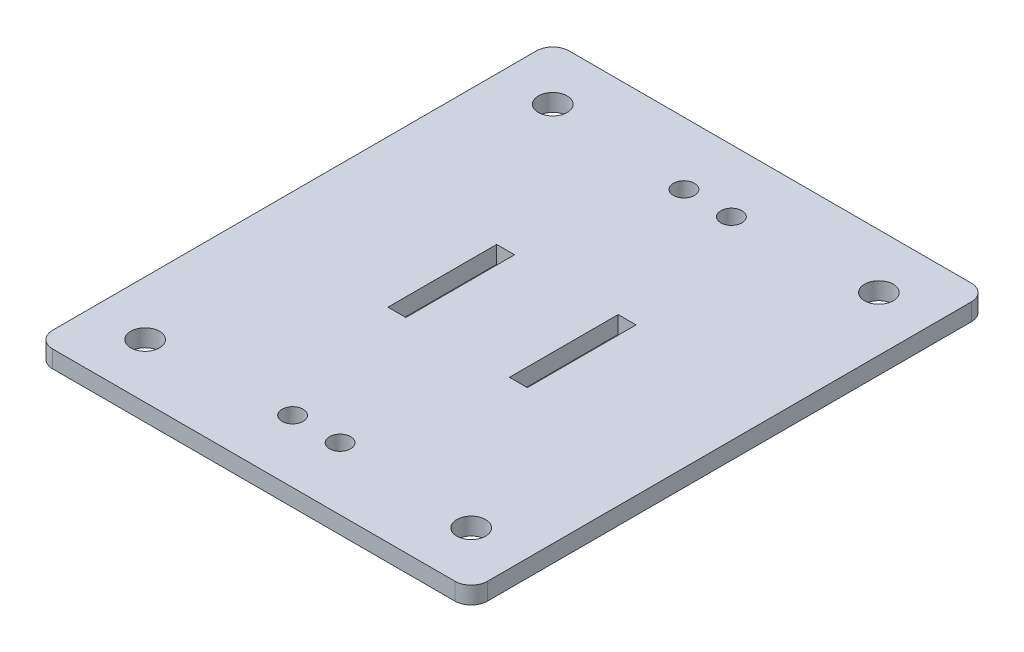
ISO-10303-21;
HEADER;
FILE_DESCRIPTION(('STEP AP214'),'2;1');
FILE_NAME('part.step','',(''),(''),'','','');
FILE_SCHEMA(('AUTOMOTIVE_DESIGN { 1 0 10303 214 1 1 1 1 }'));
ENDSEC;
DATA;
#1=APPLICATION_CONTEXT('core data for automotive mechanical design processes');
#2=APPLICATION_PROTOCOL_DEFINITION('international standard','automotive_design',2000,#1);
#3=PRODUCT_CONTEXT('',#1,'mechanical');
#4=PRODUCT('Part','Part','',(#3));
#5=PRODUCT_RELATED_PRODUCT_CATEGORY('part','',(#4));
#6=PRODUCT_DEFINITION_FORMATION('','',#4);
#7=PRODUCT_DEFINITION_CONTEXT('part definition',#1,'design');
#8=PRODUCT_DEFINITION('design','',#6,#7);
#9=PRODUCT_DEFINITION_SHAPE('','',#8);
#10=(LENGTH_UNIT() NAMED_UNIT(*) SI_UNIT(.MILLI.,.METRE.));
#11=(NAMED_UNIT(*) PLANE_ANGLE_UNIT() SI_UNIT($,.RADIAN.));
#12=(NAMED_UNIT(*) SI_UNIT($,.STERADIAN.) SOLID_ANGLE_UNIT());
#13=UNCERTAINTY_MEASURE_WITH_UNIT(LENGTH_MEASURE(1.E-05),#10,'distance_accuracy_value','');
#14=(GEOMETRIC_REPRESENTATION_CONTEXT(3) GLOBAL_UNCERTAINTY_ASSIGNED_CONTEXT((#13)) GLOBAL_UNIT_ASSIGNED_CONTEXT((#10,
#11,#12)) REPRESENTATION_CONTEXT('',''));
#15=CARTESIAN_POINT('',(0.,0.,0.));
#16=DIRECTION('',(0.,0.,1.));
#17=DIRECTION('',(1.,0.,0.));
#18=AXIS2_PLACEMENT_3D('',#15,#16,#17);
#19=CARTESIAN_POINT('',(0.,3.175,0.));
#20=DIRECTION('',(0.,-1.,0.));
#21=DIRECTION('',(0.,0.,-1.));
#22=AXIS2_PLACEMENT_3D('',#19,#20,#21);
#23=PLANE('',#22);
#24=DIRECTION('',(0.,0.,-1.));
#25=VECTOR('',#24,1.);
#26=CARTESIAN_POINT('',(52.825,3.175,-37.5));
#27=LINE('',#26,#25);
#28=CARTESIAN_POINT('',(52.825,3.175,-37.5));
#29=VERTEX_POINT('',#28);
#30=CARTESIAN_POINT('',(52.825,3.175,-57.5));
#31=VERTEX_POINT('',#30);
#32=EDGE_CURVE('E195',#29,#31,#27,.T.);
#33=ORIENTED_EDGE('',*,*,#32,.F.);
#34=DIRECTION('',(1.,0.,0.));
#35=VECTOR('',#34,1.);
#36=CARTESIAN_POINT('',(49.525,3.175,-37.5));
#37=LINE('',#36,#35);
#38=CARTESIAN_POINT('',(49.525,3.175,-37.5));
#39=VERTEX_POINT('',#38);
#40=EDGE_CURVE('E203',#39,#29,#37,.T.);
#41=ORIENTED_EDGE('',*,*,#40,.F.);
#42=DIRECTION('',(0.,0.,1.));
#43=VECTOR('',#42,1.);
#44=CARTESIAN_POINT('',(49.525,3.175,-37.5));
#45=LINE('',#44,#43);
#46=CARTESIAN_POINT('',(49.525,3.175,-57.5));
#47=VERTEX_POINT('',#46);
#48=EDGE_CURVE('E200',#47,#39,#45,.T.);
#49=ORIENTED_EDGE('',*,*,#48,.F.);
#50=DIRECTION('',(-1.,0.,0.));
#51=VECTOR('',#50,1.);
#52=CARTESIAN_POINT('',(49.525,3.175,-57.5));
#53=LINE('',#52,#51);
#54=EDGE_CURVE('E197',#31,#47,#53,.T.);
#55=ORIENTED_EDGE('',*,*,#54,.F.);
#56=EDGE_LOOP('',(#33,#41,#49,#55));
#57=FACE_BOUND('',#56,.T.);
#58=DIRECTION('',(-1.,0.,0.));
#59=VECTOR('',#58,1.);
#60=CARTESIAN_POINT('',(0.,3.175,-95.));
#61=LINE('',#60,#59);
#62=CARTESIAN_POINT('',(77.,3.175,-95.));
#63=VERTEX_POINT('',#62);
#64=CARTESIAN_POINT('',(3.,3.175,-95.));
#65=VERTEX_POINT('',#64);
#66=EDGE_CURVE('E234',#63,#65,#61,.T.);
#67=ORIENTED_EDGE('',*,*,#66,.T.);
#68=CARTESIAN_POINT('',(3.,3.175,-92.));
#69=DIRECTION('',(0.,-1.,0.));
#70=DIRECTION('',(0.,0.,-1.));
#71=AXIS2_PLACEMENT_3D('',#68,#69,#70);
#72=CIRCLE('',#71,3.);
#73=CARTESIAN_POINT('',(0.,3.175,-92.));
#74=VERTEX_POINT('',#73);
#75=EDGE_CURVE('E269',#65,#74,#72,.F.);
#76=ORIENTED_EDGE('',*,*,#75,.T.);
#77=DIRECTION('',(0.,0.,1.));
#78=VECTOR('',#77,1.);
#79=CARTESIAN_POINT('',(0.,3.175,0.));
#80=LINE('',#79,#78);
#81=CARTESIAN_POINT('',(0.,3.175,-3.));
#82=VERTEX_POINT('',#81);
#83=EDGE_CURVE('E226',#74,#82,#80,.T.);
#84=ORIENTED_EDGE('',*,*,#83,.T.);
#85=CARTESIAN_POINT('',(3.,3.175,-3.));
#86=DIRECTION('',(0.,-1.,0.));
#87=DIRECTION('',(0.,0.,-1.));
#88=AXIS2_PLACEMENT_3D('',#85,#86,#87);
#89=CIRCLE('',#88,3.);
#90=CARTESIAN_POINT('',(3.,3.175,0.));
#91=VERTEX_POINT('',#90);
#92=EDGE_CURVE('E265',#82,#91,#89,.F.);
#93=ORIENTED_EDGE('',*,*,#92,.T.);
#94=DIRECTION('',(1.,0.,0.));
#95=VECTOR('',#94,1.);
#96=CARTESIAN_POINT('',(0.,3.175,0.));
#97=LINE('',#96,#95);
#98=CARTESIAN_POINT('',(77.,3.175,0.));
#99=VERTEX_POINT('',#98);
#100=EDGE_CURVE('E229',#91,#99,#97,.T.);
#101=ORIENTED_EDGE('',*,*,#100,.T.);
#102=CARTESIAN_POINT('',(77.,3.175,-3.));
#103=DIRECTION('',(0.,-1.,0.));
#104=DIRECTION('',(0.,0.,-1.));
#105=AXIS2_PLACEMENT_3D('',#102,#103,#104);
#106=CIRCLE('',#105,3.);
#107=CARTESIAN_POINT('',(80.,3.175,-3.));
#108=VERTEX_POINT('',#107);
#109=EDGE_CURVE('E57',#99,#108,#106,.F.);
#110=ORIENTED_EDGE('',*,*,#109,.T.);
#111=DIRECTION('',(0.,0.,-1.));
#112=VECTOR('',#111,1.);
#113=CARTESIAN_POINT('',(80.,3.175,0.));
#114=LINE('',#113,#112);
#115=CARTESIAN_POINT('',(80.,3.175,-92.));
#116=VERTEX_POINT('',#115);
#117=EDGE_CURVE('E232',#108,#116,#114,.T.);
#118=ORIENTED_EDGE('',*,*,#117,.T.);
#119=CARTESIAN_POINT('',(77.,3.175,-92.));
#120=DIRECTION('',(0.,-1.,0.));
#121=DIRECTION('',(0.,0.,-1.));
#122=AXIS2_PLACEMENT_3D('',#119,#120,#121);
#123=CIRCLE('',#122,3.);
#124=EDGE_CURVE('E267',#116,#63,#123,.F.);
#125=ORIENTED_EDGE('',*,*,#124,.T.);
#126=EDGE_LOOP('',(#67,#76,#84,#93,#101,#110,#118,#125));
#127=FACE_BOUND('',#126,.T.);
#128=DIRECTION('',(1.,0.,0.));
#129=VECTOR('',#128,1.);
#130=CARTESIAN_POINT('',(30.475,3.175,-37.5));
#131=LINE('',#130,#129);
#132=CARTESIAN_POINT('',(27.175,3.175,-37.5));
#133=VERTEX_POINT('',#132);
#134=CARTESIAN_POINT('',(30.475,3.175,-37.5));
#135=VERTEX_POINT('',#134);
#136=EDGE_CURVE('E151',#133,#135,#131,.T.);
#137=ORIENTED_EDGE('',*,*,#136,.F.);
#138=DIRECTION('',(0.,0.,1.));
#139=VECTOR('',#138,1.);
#140=CARTESIAN_POINT('',(27.175,3.175,-37.5));
#141=LINE('',#140,#139);
#142=CARTESIAN_POINT('',(27.175,3.175,-57.5));
#143=VERTEX_POINT('',#142);
#144=EDGE_CURVE('E177',#143,#133,#141,.T.);
#145=ORIENTED_EDGE('',*,*,#144,.F.);
#146=DIRECTION('',(-1.,0.,0.));
#147=VECTOR('',#146,1.);
#148=CARTESIAN_POINT('',(30.475,3.175,-57.5));
#149=LINE('',#148,#147);
#150=CARTESIAN_POINT('',(30.475,3.175,-57.5));
#151=VERTEX_POINT('',#150);
#152=EDGE_CURVE('E175',#151,#143,#149,.T.);
#153=ORIENTED_EDGE('',*,*,#152,.F.);
#154=DIRECTION('',(0.,0.,-1.));
#155=VECTOR('',#154,1.);
#156=CARTESIAN_POINT('',(30.475,3.175,-37.5));
#157=LINE('',#156,#155);
#158=EDGE_CURVE('E161',#135,#151,#157,.T.);
#159=ORIENTED_EDGE('',*,*,#158,.F.);
#160=EDGE_LOOP('',(#137,#145,#153,#159));
#161=FACE_BOUND('',#160,.T.);
#162=CARTESIAN_POINT('',(44.3688,3.175,-83.5));
#163=DIRECTION('',(0.,1.,0.));
#164=DIRECTION('',(0.,0.,1.));
#165=AXIS2_PLACEMENT_3D('',#162,#163,#164);
#166=CIRCLE('',#165,1.94310000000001);
#167=CARTESIAN_POINT('',(44.3688,3.175,-81.5569));
#168=VERTEX_POINT('',#167);
#169=EDGE_CURVE('E184',#168,#168,#166,.T.);
#170=ORIENTED_EDGE('',*,*,#169,.F.);
#171=EDGE_LOOP('',(#170));
#172=FACE_BOUND('',#171,.T.);
#173=CARTESIAN_POINT('',(35.6312,3.175,-83.5));
#174=DIRECTION('',(0.,1.,0.));
#175=DIRECTION('',(0.,0.,-1.));
#176=AXIS2_PLACEMENT_3D('',#173,#174,#175);
#177=CIRCLE('',#176,1.94310000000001);
#178=CARTESIAN_POINT('',(35.6312,3.175,-85.4431));
#179=VERTEX_POINT('',#178);
#180=EDGE_CURVE('E457',#179,#179,#177,.T.);
#181=ORIENTED_EDGE('',*,*,#180,.F.);
#182=EDGE_LOOP('',(#181));
#183=FACE_BOUND('',#182,.T.);
#184=CARTESIAN_POINT('',(44.3688,3.175,-11.5));
#185=DIRECTION('',(0.,1.,0.));
#186=DIRECTION('',(0.,0.,-1.));
#187=AXIS2_PLACEMENT_3D('',#184,#185,#186);
#188=CIRCLE('',#187,1.9431);
#189=CARTESIAN_POINT('',(44.3688,3.175,-13.4431));
#190=VERTEX_POINT('',#189);
#191=EDGE_CURVE('E452',#190,#190,#188,.T.);
#192=ORIENTED_EDGE('',*,*,#191,.F.);
#193=EDGE_LOOP('',(#192));
#194=FACE_BOUND('',#193,.T.);
#195=CARTESIAN_POINT('',(35.6312,3.175,-11.5));
#196=DIRECTION('',(0.,1.,0.));
#197=DIRECTION('',(0.,0.,1.));
#198=AXIS2_PLACEMENT_3D('',#195,#196,#197);
#199=CIRCLE('',#198,1.9431);
#200=CARTESIAN_POINT('',(35.6312,3.175,-9.55690000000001));
#201=VERTEX_POINT('',#200);
#202=EDGE_CURVE('E447',#201,#201,#199,.T.);
#203=ORIENTED_EDGE('',*,*,#202,.F.);
#204=EDGE_LOOP('',(#203));
#205=FACE_BOUND('',#204,.T.);
#206=CARTESIAN_POINT('',(70.,3.175,-10.));
#207=DIRECTION('',(0.,1.,0.));
#208=DIRECTION('',(0.,0.,1.));
#209=AXIS2_PLACEMENT_3D('',#206,#207,#208);
#210=CIRCLE('',#209,2.65);
#211=CARTESIAN_POINT('',(70.,3.175,-7.35));
#212=VERTEX_POINT('',#211);
#213=EDGE_CURVE('E442',#212,#212,#210,.T.);
#214=ORIENTED_EDGE('',*,*,#213,.F.);
#215=EDGE_LOOP('',(#214));
#216=FACE_BOUND('',#215,.T.);
#217=CARTESIAN_POINT('',(10.,3.175,-10.));
#218=DIRECTION('',(0.,1.,0.));
#219=DIRECTION('',(0.,0.,1.));
#220=AXIS2_PLACEMENT_3D('',#217,#218,#219);
#221=CIRCLE('',#220,2.65);
#222=CARTESIAN_POINT('',(10.,3.175,-7.35));
#223=VERTEX_POINT('',#222);
#224=EDGE_CURVE('E437',#223,#223,#221,.T.);
#225=ORIENTED_EDGE('',*,*,#224,.F.);
#226=EDGE_LOOP('',(#225));
#227=FACE_BOUND('',#226,.T.);
#228=CARTESIAN_POINT('',(70.,3.175,-85.));
#229=DIRECTION('',(0.,1.,0.));
#230=DIRECTION('',(0.,0.,1.));
#231=AXIS2_PLACEMENT_3D('',#228,#229,#230);
#232=CIRCLE('',#231,2.65);
#233=CARTESIAN_POINT('',(70.,3.175,-82.35));
#234=VERTEX_POINT('',#233);
#235=EDGE_CURVE('E432',#234,#234,#232,.T.);
#236=ORIENTED_EDGE('',*,*,#235,.F.);
#237=EDGE_LOOP('',(#236));
#238=FACE_BOUND('',#237,.T.);
#239=CARTESIAN_POINT('',(10.,3.175,-85.));
#240=DIRECTION('',(0.,1.,0.));
#241=DIRECTION('',(0.,0.,1.));
#242=AXIS2_PLACEMENT_3D('',#239,#240,#241);
#243=CIRCLE('',#242,2.65);
#244=CARTESIAN_POINT('',(10.,3.175,-82.35));
#245=VERTEX_POINT('',#244);
#246=EDGE_CURVE('E427',#245,#245,#243,.T.);
#247=ORIENTED_EDGE('',*,*,#246,.F.);
#248=EDGE_LOOP('',(#247));
#249=FACE_BOUND('',#248,.T.);
#250=ADVANCED_FACE('F35',(#57,#127,#161,#172,#183,#194,#205,#216,#227,#238,#249),#23,.F.);
#251=CARTESIAN_POINT('',(0.,0.,0.));
#252=DIRECTION('',(0.,-1.,0.));
#253=DIRECTION('',(0.,0.,-1.));
#254=AXIS2_PLACEMENT_3D('',#251,#252,#253);
#255=PLANE('',#254);
#256=CARTESIAN_POINT('',(70.,0.,-85.));
#257=DIRECTION('',(0.,1.,0.));
#258=DIRECTION('',(0.,0.,1.));
#259=AXIS2_PLACEMENT_3D('',#256,#257,#258);
#260=CIRCLE('',#259,2.65);
#261=CARTESIAN_POINT('',(70.,0.,-82.35));
#262=VERTEX_POINT('',#261);
#263=EDGE_CURVE('E429',#262,#262,#260,.T.);
#264=ORIENTED_EDGE('',*,*,#263,.T.);
#265=EDGE_LOOP('',(#264));
#266=FACE_BOUND('',#265,.T.);
#267=CARTESIAN_POINT('',(70.,0.,-10.));
#268=DIRECTION('',(0.,1.,0.));
#269=DIRECTION('',(0.,0.,1.));
#270=AXIS2_PLACEMENT_3D('',#267,#268,#269);
#271=CIRCLE('',#270,2.65);
#272=CARTESIAN_POINT('',(70.,0.,-7.35));
#273=VERTEX_POINT('',#272);
#274=EDGE_CURVE('E440',#273,#273,#271,.T.);
#275=ORIENTED_EDGE('',*,*,#274,.T.);
#276=EDGE_LOOP('',(#275));
#277=FACE_BOUND('',#276,.T.);
#278=CARTESIAN_POINT('',(44.3688,0.,-11.5));
#279=DIRECTION('',(0.,1.,0.));
#280=DIRECTION('',(0.,0.,-1.));
#281=AXIS2_PLACEMENT_3D('',#278,#279,#280);
#282=CIRCLE('',#281,1.9431);
#283=CARTESIAN_POINT('',(44.3688,0.,-13.4431));
#284=VERTEX_POINT('',#283);
#285=EDGE_CURVE('E450',#284,#284,#282,.T.);
#286=ORIENTED_EDGE('',*,*,#285,.T.);
#287=EDGE_LOOP('',(#286));
#288=FACE_BOUND('',#287,.T.);
#289=CARTESIAN_POINT('',(44.3688,0.,-83.5));
#290=DIRECTION('',(0.,1.,0.));
#291=DIRECTION('',(0.,0.,1.));
#292=AXIS2_PLACEMENT_3D('',#289,#290,#291);
#293=CIRCLE('',#292,1.94310000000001);
#294=CARTESIAN_POINT('',(44.3688,0.,-81.5569));
#295=VERTEX_POINT('',#294);
#296=EDGE_CURVE('E460',#295,#295,#293,.T.);
#297=ORIENTED_EDGE('',*,*,#296,.T.);
#298=EDGE_LOOP('',(#297));
#299=FACE_BOUND('',#298,.T.);
#300=DIRECTION('',(0.,0.,1.));
#301=VECTOR('',#300,1.);
#302=CARTESIAN_POINT('',(0.,0.,0.));
#303=LINE('',#302,#301);
#304=CARTESIAN_POINT('',(0.,0.,-92.));
#305=VERTEX_POINT('',#304);
#306=CARTESIAN_POINT('',(0.,0.,-3.));
#307=VERTEX_POINT('',#306);
#308=EDGE_CURVE('E225',#305,#307,#303,.T.);
#309=ORIENTED_EDGE('',*,*,#308,.F.);
#310=CARTESIAN_POINT('',(3.,0.,-92.));
#311=DIRECTION('',(0.,-1.,0.));
#312=DIRECTION('',(0.,0.,-1.));
#313=AXIS2_PLACEMENT_3D('',#310,#311,#312);
#314=CIRCLE('',#313,3.);
#315=CARTESIAN_POINT('',(3.,0.,-95.));
#316=VERTEX_POINT('',#315);
#317=EDGE_CURVE('E257',#305,#316,#314,.T.);
#318=ORIENTED_EDGE('',*,*,#317,.T.);
#319=DIRECTION('',(-1.,0.,0.));
#320=VECTOR('',#319,1.);
#321=CARTESIAN_POINT('',(0.,0.,-95.));
#322=LINE('',#321,#320);
#323=CARTESIAN_POINT('',(77.,0.,-95.));
#324=VERTEX_POINT('',#323);
#325=EDGE_CURVE('E230',#324,#316,#322,.T.);
#326=ORIENTED_EDGE('',*,*,#325,.F.);
#327=CARTESIAN_POINT('',(77.,0.,-92.));
#328=DIRECTION('',(0.,-1.,0.));
#329=DIRECTION('',(0.,0.,-1.));
#330=AXIS2_PLACEMENT_3D('',#327,#328,#329);
#331=CIRCLE('',#330,3.);
#332=CARTESIAN_POINT('',(80.,0.,-92.));
#333=VERTEX_POINT('',#332);
#334=EDGE_CURVE('E255',#324,#333,#331,.T.);
#335=ORIENTED_EDGE('',*,*,#334,.T.);
#336=DIRECTION('',(0.,0.,-1.));
#337=VECTOR('',#336,1.);
#338=CARTESIAN_POINT('',(80.,0.,0.));
#339=LINE('',#338,#337);
#340=CARTESIAN_POINT('',(80.,0.,-3.));
#341=VERTEX_POINT('',#340);
#342=EDGE_CURVE('E243',#341,#333,#339,.T.);
#343=ORIENTED_EDGE('',*,*,#342,.F.);
#344=CARTESIAN_POINT('',(77.,0.,-3.));
#345=DIRECTION('',(0.,-1.,0.));
#346=DIRECTION('',(0.,0.,-1.));
#347=AXIS2_PLACEMENT_3D('',#344,#345,#346);
#348=CIRCLE('',#347,3.);
#349=CARTESIAN_POINT('',(77.,0.,0.));
#350=VERTEX_POINT('',#349);
#351=EDGE_CURVE('E251',#341,#350,#348,.T.);
#352=ORIENTED_EDGE('',*,*,#351,.T.);
#353=DIRECTION('',(1.,0.,0.));
#354=VECTOR('',#353,1.);
#355=CARTESIAN_POINT('',(0.,0.,0.));
#356=LINE('',#355,#354);
#357=CARTESIAN_POINT('',(3.,0.,0.));
#358=VERTEX_POINT('',#357);
#359=EDGE_CURVE('E240',#358,#350,#356,.T.);
#360=ORIENTED_EDGE('',*,*,#359,.F.);
#361=CARTESIAN_POINT('',(3.,0.,-3.));
#362=DIRECTION('',(0.,-1.,0.));
#363=DIRECTION('',(0.,0.,-1.));
#364=AXIS2_PLACEMENT_3D('',#361,#362,#363);
#365=CIRCLE('',#364,3.);
#366=EDGE_CURVE('E253',#358,#307,#365,.T.);
#367=ORIENTED_EDGE('',*,*,#366,.T.);
#368=EDGE_LOOP('',(#309,#318,#326,#335,#343,#352,#360,#367));
#369=FACE_BOUND('',#368,.T.);
#370=DIRECTION('',(1.,0.,0.));
#371=VECTOR('',#370,1.);
#372=CARTESIAN_POINT('',(49.525,0.,-37.5));
#373=LINE('',#372,#371);
#374=CARTESIAN_POINT('',(49.525,0.,-37.5));
#375=VERTEX_POINT('',#374);
#376=CARTESIAN_POINT('',(52.825,0.,-37.5));
#377=VERTEX_POINT('',#376);
#378=EDGE_CURVE('E198',#375,#377,#373,.T.);
#379=ORIENTED_EDGE('',*,*,#378,.T.);
#380=DIRECTION('',(0.,0.,-1.));
#381=VECTOR('',#380,1.);
#382=CARTESIAN_POINT('',(52.825,0.,-37.5));
#383=LINE('',#382,#381);
#384=CARTESIAN_POINT('',(52.825,0.,-57.5));
#385=VERTEX_POINT('',#384);
#386=EDGE_CURVE('E169',#377,#385,#383,.T.);
#387=ORIENTED_EDGE('',*,*,#386,.T.);
#388=DIRECTION('',(-1.,0.,0.));
#389=VECTOR('',#388,1.);
#390=CARTESIAN_POINT('',(49.525,0.,-57.5));
#391=LINE('',#390,#389);
#392=CARTESIAN_POINT('',(49.525,0.,-57.5));
#393=VERTEX_POINT('',#392);
#394=EDGE_CURVE('E208',#385,#393,#391,.T.);
#395=ORIENTED_EDGE('',*,*,#394,.T.);
#396=DIRECTION('',(0.,0.,1.));
#397=VECTOR('',#396,1.);
#398=CARTESIAN_POINT('',(49.525,0.,-37.5));
#399=LINE('',#398,#397);
#400=EDGE_CURVE('E211',#393,#375,#399,.T.);
#401=ORIENTED_EDGE('',*,*,#400,.T.);
#402=EDGE_LOOP('',(#379,#387,#395,#401));
#403=FACE_BOUND('',#402,.T.);
#404=DIRECTION('',(0.,0.,1.));
#405=VECTOR('',#404,1.);
#406=CARTESIAN_POINT('',(27.175,0.,-37.5));
#407=LINE('',#406,#405);
#408=CARTESIAN_POINT('',(27.175,0.,-57.5));
#409=VERTEX_POINT('',#408);
#410=CARTESIAN_POINT('',(27.175,0.,-37.5));
#411=VERTEX_POINT('',#410);
#412=EDGE_CURVE('E162',#409,#411,#407,.T.);
#413=ORIENTED_EDGE('',*,*,#412,.T.);
#414=DIRECTION('',(1.,0.,0.));
#415=VECTOR('',#414,1.);
#416=CARTESIAN_POINT('',(30.475,0.,-37.5));
#417=LINE('',#416,#415);
#418=CARTESIAN_POINT('',(30.475,0.,-37.5));
#419=VERTEX_POINT('',#418);
#420=EDGE_CURVE('E182',#411,#419,#417,.T.);
#421=ORIENTED_EDGE('',*,*,#420,.T.);
#422=DIRECTION('',(0.,0.,-1.));
#423=VECTOR('',#422,1.);
#424=CARTESIAN_POINT('',(30.475,0.,-37.5));
#425=LINE('',#424,#423);
#426=CARTESIAN_POINT('',(30.475,0.,-57.5));
#427=VERTEX_POINT('',#426);
#428=EDGE_CURVE('E168',#419,#427,#425,.T.);
#429=ORIENTED_EDGE('',*,*,#428,.T.);
#430=DIRECTION('',(-1.,0.,0.));
#431=VECTOR('',#430,1.);
#432=CARTESIAN_POINT('',(30.475,0.,-57.5));
#433=LINE('',#432,#431);
#434=EDGE_CURVE('E186',#427,#409,#433,.T.);
#435=ORIENTED_EDGE('',*,*,#434,.T.);
#436=EDGE_LOOP('',(#413,#421,#429,#435));
#437=FACE_BOUND('',#436,.T.);
#438=CARTESIAN_POINT('',(35.6312,0.,-83.5));
#439=DIRECTION('',(0.,1.,0.));
#440=DIRECTION('',(0.,0.,-1.));
#441=AXIS2_PLACEMENT_3D('',#438,#439,#440);
#442=CIRCLE('',#441,1.94310000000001);
#443=CARTESIAN_POINT('',(35.6312,0.,-85.4431));
#444=VERTEX_POINT('',#443);
#445=EDGE_CURVE('E415',#444,#444,#442,.T.);
#446=ORIENTED_EDGE('',*,*,#445,.T.);
#447=EDGE_LOOP('',(#446));
#448=FACE_BOUND('',#447,.T.);
#449=CARTESIAN_POINT('',(35.6312,0.,-11.5));
#450=DIRECTION('',(0.,1.,0.));
#451=DIRECTION('',(0.,0.,1.));
#452=AXIS2_PLACEMENT_3D('',#449,#450,#451);
#453=CIRCLE('',#452,1.9431);
#454=CARTESIAN_POINT('',(35.6312,0.,-9.55690000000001));
#455=VERTEX_POINT('',#454);
#456=EDGE_CURVE('E419',#455,#455,#453,.T.);
#457=ORIENTED_EDGE('',*,*,#456,.T.);
#458=EDGE_LOOP('',(#457));
#459=FACE_BOUND('',#458,.T.);
#460=CARTESIAN_POINT('',(10.,0.,-10.));
#461=DIRECTION('',(0.,1.,0.));
#462=DIRECTION('',(0.,0.,1.));
#463=AXIS2_PLACEMENT_3D('',#460,#461,#462);
#464=CIRCLE('',#463,2.65);
#465=CARTESIAN_POINT('',(10.,0.,-7.35));
#466=VERTEX_POINT('',#465);
#467=EDGE_CURVE('E423',#466,#466,#464,.T.);
#468=ORIENTED_EDGE('',*,*,#467,.T.);
#469=EDGE_LOOP('',(#468));
#470=FACE_BOUND('',#469,.T.);
#471=CARTESIAN_POINT('',(10.,0.,-85.));
#472=DIRECTION('',(0.,1.,0.));
#473=DIRECTION('',(0.,0.,1.));
#474=AXIS2_PLACEMENT_3D('',#471,#472,#473);
#475=CIRCLE('',#474,2.65);
#476=CARTESIAN_POINT('',(10.,0.,-82.35));
#477=VERTEX_POINT('',#476);
#478=EDGE_CURVE('E426',#477,#477,#475,.T.);
#479=ORIENTED_EDGE('',*,*,#478,.T.);
#480=EDGE_LOOP('',(#479));
#481=FACE_BOUND('',#480,.T.);
#482=ADVANCED_FACE('F287',(#266,#277,#288,#299,#369,#403,#437,#448,#459,#470,#481),#255,.T.);
#483=CARTESIAN_POINT('',(0.,3.175,0.));
#484=DIRECTION('',(1.,0.,0.));
#485=DIRECTION('',(0.,0.,-1.));
#486=AXIS2_PLACEMENT_3D('',#483,#484,#485);
#487=PLANE('',#486);
#488=ORIENTED_EDGE('',*,*,#83,.F.);
#489=DIRECTION('',(0.,-1.,0.));
#490=VECTOR('',#489,1.);
#491=CARTESIAN_POINT('',(0.,3.175,-92.));
#492=LINE('',#491,#490);
#493=EDGE_CURVE('E248',#74,#305,#492,.T.);
#494=ORIENTED_EDGE('',*,*,#493,.T.);
#495=ORIENTED_EDGE('',*,*,#308,.T.);
#496=DIRECTION('',(0.,-1.,0.));
#497=VECTOR('',#496,1.);
#498=CARTESIAN_POINT('',(0.,3.175,-3.));
#499=LINE('',#498,#497);
#500=EDGE_CURVE('E237',#307,#82,#499,.F.);
#501=ORIENTED_EDGE('',*,*,#500,.T.);
#502=EDGE_LOOP('',(#488,#494,#495,#501));
#503=FACE_BOUND('',#502,.T.);
#504=ADVANCED_FACE('F304',(#503),#487,.F.);
#505=CARTESIAN_POINT('',(0.,3.175,0.));
#506=DIRECTION('',(0.,0.,-1.));
#507=DIRECTION('',(-1.,0.,0.));
#508=AXIS2_PLACEMENT_3D('',#505,#506,#507);
#509=PLANE('',#508);
#510=ORIENTED_EDGE('',*,*,#100,.F.);
#511=DIRECTION('',(0.,-1.,0.));
#512=VECTOR('',#511,1.);
#513=CARTESIAN_POINT('',(3.,3.175,0.));
#514=LINE('',#513,#512);
#515=EDGE_CURVE('E11',#91,#358,#514,.T.);
#516=ORIENTED_EDGE('',*,*,#515,.T.);
#517=ORIENTED_EDGE('',*,*,#359,.T.);
#518=DIRECTION('',(0.,-1.,0.));
#519=VECTOR('',#518,1.);
#520=CARTESIAN_POINT('',(77.,3.175,0.));
#521=LINE('',#520,#519);
#522=EDGE_CURVE('E43',#350,#99,#521,.F.);
#523=ORIENTED_EDGE('',*,*,#522,.T.);
#524=EDGE_LOOP('',(#510,#516,#517,#523));
#525=FACE_BOUND('',#524,.T.);
#526=ADVANCED_FACE('F277',(#525),#509,.F.);
#527=CARTESIAN_POINT('',(80.,3.175,0.));
#528=DIRECTION('',(-1.,0.,0.));
#529=DIRECTION('',(0.,0.,1.));
#530=AXIS2_PLACEMENT_3D('',#527,#528,#529);
#531=PLANE('',#530);
#532=ORIENTED_EDGE('',*,*,#342,.T.);
#533=DIRECTION('',(0.,-1.,0.));
#534=VECTOR('',#533,1.);
#535=CARTESIAN_POINT('',(80.,3.175,-92.));
#536=LINE('',#535,#534);
#537=EDGE_CURVE('E50',#333,#116,#536,.F.);
#538=ORIENTED_EDGE('',*,*,#537,.T.);
#539=ORIENTED_EDGE('',*,*,#117,.F.);
#540=DIRECTION('',(0.,-1.,0.));
#541=VECTOR('',#540,1.);
#542=CARTESIAN_POINT('',(80.,3.175,-3.));
#543=LINE('',#542,#541);
#544=EDGE_CURVE('E271',#108,#341,#543,.T.);
#545=ORIENTED_EDGE('',*,*,#544,.T.);
#546=EDGE_LOOP('',(#532,#538,#539,#545));
#547=FACE_BOUND('',#546,.T.);
#548=ADVANCED_FACE('F284',(#547),#531,.F.);
#549=CARTESIAN_POINT('',(0.,3.175,-95.));
#550=DIRECTION('',(0.,0.,1.));
#551=DIRECTION('',(1.,0.,0.));
#552=AXIS2_PLACEMENT_3D('',#549,#550,#551);
#553=PLANE('',#552);
#554=ORIENTED_EDGE('',*,*,#325,.T.);
#555=DIRECTION('',(0.,-1.,0.));
#556=VECTOR('',#555,1.);
#557=CARTESIAN_POINT('',(3.,3.175,-95.));
#558=LINE('',#557,#556);
#559=EDGE_CURVE('E262',#316,#65,#558,.F.);
#560=ORIENTED_EDGE('',*,*,#559,.T.);
#561=ORIENTED_EDGE('',*,*,#66,.F.);
#562=DIRECTION('',(0.,-1.,0.));
#563=VECTOR('',#562,1.);
#564=CARTESIAN_POINT('',(77.,3.175,-95.));
#565=LINE('',#564,#563);
#566=EDGE_CURVE('E259',#63,#324,#565,.T.);
#567=ORIENTED_EDGE('',*,*,#566,.T.);
#568=EDGE_LOOP('',(#554,#560,#561,#567));
#569=FACE_BOUND('',#568,.T.);
#570=ADVANCED_FACE('F296',(#569),#553,.F.);
#571=CARTESIAN_POINT('',(52.825,3.175,-37.5));
#572=DIRECTION('',(-1.,0.,0.));
#573=DIRECTION('',(0.,0.,1.));
#574=AXIS2_PLACEMENT_3D('',#571,#572,#573);
#575=PLANE('',#574);
#576=ORIENTED_EDGE('',*,*,#386,.F.);
#577=DIRECTION('',(0.,-1.,0.));
#578=VECTOR('',#577,1.);
#579=CARTESIAN_POINT('',(52.825,3.175,-37.5));
#580=LINE('',#579,#578);
#581=EDGE_CURVE('E205',#29,#377,#580,.T.);
#582=ORIENTED_EDGE('',*,*,#581,.F.);
#583=ORIENTED_EDGE('',*,*,#32,.T.);
#584=DIRECTION('',(0.,-1.,0.));
#585=VECTOR('',#584,1.);
#586=CARTESIAN_POINT('',(52.825,3.175,-57.5));
#587=LINE('',#586,#585);
#588=EDGE_CURVE('E222',#31,#385,#587,.T.);
#589=ORIENTED_EDGE('',*,*,#588,.T.);
#590=EDGE_LOOP('',(#576,#582,#583,#589));
#591=FACE_BOUND('',#590,.T.);
#592=ADVANCED_FACE('F324',(#591),#575,.T.);
#593=CARTESIAN_POINT('',(49.525,3.175,-57.5));
#594=DIRECTION('',(0.,0.,1.));
#595=DIRECTION('',(1.,0.,0.));
#596=AXIS2_PLACEMENT_3D('',#593,#594,#595);
#597=PLANE('',#596);
#598=ORIENTED_EDGE('',*,*,#394,.F.);
#599=ORIENTED_EDGE('',*,*,#588,.F.);
#600=ORIENTED_EDGE('',*,*,#54,.T.);
#601=DIRECTION('',(0.,-1.,0.));
#602=VECTOR('',#601,1.);
#603=CARTESIAN_POINT('',(49.525,3.175,-57.5));
#604=LINE('',#603,#602);
#605=EDGE_CURVE('E220',#47,#393,#604,.T.);
#606=ORIENTED_EDGE('',*,*,#605,.T.);
#607=EDGE_LOOP('',(#598,#599,#600,#606));
#608=FACE_BOUND('',#607,.T.);
#609=ADVANCED_FACE('F393',(#608),#597,.T.);
#610=CARTESIAN_POINT('',(49.525,3.175,-37.5));
#611=DIRECTION('',(1.,0.,0.));
#612=DIRECTION('',(0.,0.,-1.));
#613=AXIS2_PLACEMENT_3D('',#610,#611,#612);
#614=PLANE('',#613);
#615=ORIENTED_EDGE('',*,*,#400,.F.);
#616=ORIENTED_EDGE('',*,*,#605,.F.);
#617=ORIENTED_EDGE('',*,*,#48,.T.);
#618=DIRECTION('',(0.,-1.,0.));
#619=VECTOR('',#618,1.);
#620=CARTESIAN_POINT('',(49.525,3.175,-37.5));
#621=LINE('',#620,#619);
#622=EDGE_CURVE('E218',#39,#375,#621,.T.);
#623=ORIENTED_EDGE('',*,*,#622,.T.);
#624=EDGE_LOOP('',(#615,#616,#617,#623));
#625=FACE_BOUND('',#624,.T.);
#626=ADVANCED_FACE('F390',(#625),#614,.T.);
#627=CARTESIAN_POINT('',(49.525,3.175,-37.5));
#628=DIRECTION('',(0.,0.,-1.));
#629=DIRECTION('',(-1.,0.,0.));
#630=AXIS2_PLACEMENT_3D('',#627,#628,#629);
#631=PLANE('',#630);
#632=ORIENTED_EDGE('',*,*,#378,.F.);
#633=ORIENTED_EDGE('',*,*,#622,.F.);
#634=ORIENTED_EDGE('',*,*,#40,.T.);
#635=ORIENTED_EDGE('',*,*,#581,.T.);
#636=EDGE_LOOP('',(#632,#633,#634,#635));
#637=FACE_BOUND('',#636,.T.);
#638=ADVANCED_FACE('F387',(#637),#631,.T.);
#639=CARTESIAN_POINT('',(30.475,3.175,-37.5));
#640=DIRECTION('',(0.,0.,-1.));
#641=DIRECTION('',(-1.,0.,0.));
#642=AXIS2_PLACEMENT_3D('',#639,#640,#641);
#643=PLANE('',#642);
#644=ORIENTED_EDGE('',*,*,#420,.F.);
#645=DIRECTION('',(0.,-1.,0.));
#646=VECTOR('',#645,1.);
#647=CARTESIAN_POINT('',(27.175,3.175,-37.5));
#648=LINE('',#647,#646);
#649=EDGE_CURVE('E157',#133,#411,#648,.T.);
#650=ORIENTED_EDGE('',*,*,#649,.F.);
#651=ORIENTED_EDGE('',*,*,#136,.T.);
#652=DIRECTION('',(0.,-1.,0.));
#653=VECTOR('',#652,1.);
#654=CARTESIAN_POINT('',(30.475,3.175,-37.5));
#655=LINE('',#654,#653);
#656=EDGE_CURVE('E154',#135,#419,#655,.T.);
#657=ORIENTED_EDGE('',*,*,#656,.T.);
#658=EDGE_LOOP('',(#644,#650,#651,#657));
#659=FACE_BOUND('',#658,.T.);
#660=ADVANCED_FACE('F153',(#659),#643,.T.);
#661=CARTESIAN_POINT('',(30.475,3.175,-37.5));
#662=DIRECTION('',(-1.,0.,0.));
#663=DIRECTION('',(0.,0.,1.));
#664=AXIS2_PLACEMENT_3D('',#661,#662,#663);
#665=PLANE('',#664);
#666=ORIENTED_EDGE('',*,*,#428,.F.);
#667=ORIENTED_EDGE('',*,*,#656,.F.);
#668=ORIENTED_EDGE('',*,*,#158,.T.);
#669=DIRECTION('',(0.,-1.,0.));
#670=VECTOR('',#669,1.);
#671=CARTESIAN_POINT('',(30.475,3.175,-57.5));
#672=LINE('',#671,#670);
#673=EDGE_CURVE('E170',#151,#427,#672,.T.);
#674=ORIENTED_EDGE('',*,*,#673,.T.);
#675=EDGE_LOOP('',(#666,#667,#668,#674));
#676=FACE_BOUND('',#675,.T.);
#677=ADVANCED_FACE('F165',(#676),#665,.T.);
#678=CARTESIAN_POINT('',(30.475,3.175,-57.5));
#679=DIRECTION('',(0.,0.,1.));
#680=DIRECTION('',(1.,0.,0.));
#681=AXIS2_PLACEMENT_3D('',#678,#679,#680);
#682=PLANE('',#681);
#683=ORIENTED_EDGE('',*,*,#434,.F.);
#684=ORIENTED_EDGE('',*,*,#673,.F.);
#685=ORIENTED_EDGE('',*,*,#152,.T.);
#686=DIRECTION('',(0.,-1.,0.));
#687=VECTOR('',#686,1.);
#688=CARTESIAN_POINT('',(27.175,3.175,-57.5));
#689=LINE('',#688,#687);
#690=EDGE_CURVE('E192',#143,#409,#689,.T.);
#691=ORIENTED_EDGE('',*,*,#690,.T.);
#692=EDGE_LOOP('',(#683,#684,#685,#691));
#693=FACE_BOUND('',#692,.T.);
#694=ADVANCED_FACE('F378',(#693),#682,.T.);
#695=CARTESIAN_POINT('',(27.175,3.175,-37.5));
#696=DIRECTION('',(1.,0.,0.));
#697=DIRECTION('',(0.,0.,-1.));
#698=AXIS2_PLACEMENT_3D('',#695,#696,#697);
#699=PLANE('',#698);
#700=ORIENTED_EDGE('',*,*,#412,.F.);
#701=ORIENTED_EDGE('',*,*,#690,.F.);
#702=ORIENTED_EDGE('',*,*,#144,.T.);
#703=ORIENTED_EDGE('',*,*,#649,.T.);
#704=EDGE_LOOP('',(#700,#701,#702,#703));
#705=FACE_BOUND('',#704,.T.);
#706=ADVANCED_FACE('F374',(#705),#699,.T.);
#707=CARTESIAN_POINT('',(44.3688,3.175,-83.5));
#708=DIRECTION('',(0.,-1.,0.));
#709=DIRECTION('',(0.,0.,-1.));
#710=AXIS2_PLACEMENT_3D('',#707,#708,#709);
#711=CYLINDRICAL_SURFACE('',#710,1.94310000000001);
#712=ORIENTED_EDGE('',*,*,#169,.T.);
#713=EDGE_LOOP('',(#712));
#714=FACE_BOUND('',#713,.T.);
#715=ORIENTED_EDGE('',*,*,#296,.F.);
#716=EDGE_LOOP('',(#715));
#717=FACE_BOUND('',#716,.T.);
#718=ADVANCED_FACE('F370',(#714,#717),#711,.F.);
#719=CARTESIAN_POINT('',(35.6312,3.175,-83.5));
#720=DIRECTION('',(0.,-1.,0.));
#721=DIRECTION('',(0.,0.,-1.));
#722=AXIS2_PLACEMENT_3D('',#719,#720,#721);
#723=CYLINDRICAL_SURFACE('',#722,1.94310000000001);
#724=ORIENTED_EDGE('',*,*,#180,.T.);
#725=EDGE_LOOP('',(#724));
#726=FACE_BOUND('',#725,.T.);
#727=ORIENTED_EDGE('',*,*,#445,.F.);
#728=EDGE_LOOP('',(#727));
#729=FACE_BOUND('',#728,.T.);
#730=ADVANCED_FACE('F366',(#726,#729),#723,.F.);
#731=CARTESIAN_POINT('',(44.3688,3.175,-11.5));
#732=DIRECTION('',(0.,-1.,0.));
#733=DIRECTION('',(0.,0.,-1.));
#734=AXIS2_PLACEMENT_3D('',#731,#732,#733);
#735=CYLINDRICAL_SURFACE('',#734,1.9431);
#736=ORIENTED_EDGE('',*,*,#191,.T.);
#737=EDGE_LOOP('',(#736));
#738=FACE_BOUND('',#737,.T.);
#739=ORIENTED_EDGE('',*,*,#285,.F.);
#740=EDGE_LOOP('',(#739));
#741=FACE_BOUND('',#740,.T.);
#742=ADVANCED_FACE('F362',(#738,#741),#735,.F.);
#743=CARTESIAN_POINT('',(35.6312,3.175,-11.5));
#744=DIRECTION('',(0.,-1.,0.));
#745=DIRECTION('',(0.,0.,-1.));
#746=AXIS2_PLACEMENT_3D('',#743,#744,#745);
#747=CYLINDRICAL_SURFACE('',#746,1.9431);
#748=ORIENTED_EDGE('',*,*,#202,.T.);
#749=EDGE_LOOP('',(#748));
#750=FACE_BOUND('',#749,.T.);
#751=ORIENTED_EDGE('',*,*,#456,.F.);
#752=EDGE_LOOP('',(#751));
#753=FACE_BOUND('',#752,.T.);
#754=ADVANCED_FACE('F358',(#750,#753),#747,.F.);
#755=CARTESIAN_POINT('',(70.,3.175,-10.));
#756=DIRECTION('',(0.,-1.,0.));
#757=DIRECTION('',(0.,0.,-1.));
#758=AXIS2_PLACEMENT_3D('',#755,#756,#757);
#759=CYLINDRICAL_SURFACE('',#758,2.65);
#760=ORIENTED_EDGE('',*,*,#213,.T.);
#761=EDGE_LOOP('',(#760));
#762=FACE_BOUND('',#761,.T.);
#763=ORIENTED_EDGE('',*,*,#274,.F.);
#764=EDGE_LOOP('',(#763));
#765=FACE_BOUND('',#764,.T.);
#766=ADVANCED_FACE('F354',(#762,#765),#759,.F.);
#767=CARTESIAN_POINT('',(10.,3.175,-10.));
#768=DIRECTION('',(0.,-1.,0.));
#769=DIRECTION('',(0.,0.,-1.));
#770=AXIS2_PLACEMENT_3D('',#767,#768,#769);
#771=CYLINDRICAL_SURFACE('',#770,2.65);
#772=ORIENTED_EDGE('',*,*,#224,.T.);
#773=EDGE_LOOP('',(#772));
#774=FACE_BOUND('',#773,.T.);
#775=ORIENTED_EDGE('',*,*,#467,.F.);
#776=EDGE_LOOP('',(#775));
#777=FACE_BOUND('',#776,.T.);
#778=ADVANCED_FACE('F346',(#774,#777),#771,.F.);
#779=CARTESIAN_POINT('',(70.,3.175,-85.));
#780=DIRECTION('',(0.,-1.,0.));
#781=DIRECTION('',(0.,0.,-1.));
#782=AXIS2_PLACEMENT_3D('',#779,#780,#781);
#783=CYLINDRICAL_SURFACE('',#782,2.65);
#784=ORIENTED_EDGE('',*,*,#235,.T.);
#785=EDGE_LOOP('',(#784));
#786=FACE_BOUND('',#785,.T.);
#787=ORIENTED_EDGE('',*,*,#263,.F.);
#788=EDGE_LOOP('',(#787));
#789=FACE_BOUND('',#788,.T.);
#790=ADVANCED_FACE('F340',(#786,#789),#783,.F.);
#791=CARTESIAN_POINT('',(10.,3.175,-85.));
#792=DIRECTION('',(0.,-1.,0.));
#793=DIRECTION('',(0.,0.,-1.));
#794=AXIS2_PLACEMENT_3D('',#791,#792,#793);
#795=CYLINDRICAL_SURFACE('',#794,2.65);
#796=ORIENTED_EDGE('',*,*,#246,.T.);
#797=EDGE_LOOP('',(#796));
#798=FACE_BOUND('',#797,.T.);
#799=ORIENTED_EDGE('',*,*,#478,.F.);
#800=EDGE_LOOP('',(#799));
#801=FACE_BOUND('',#800,.T.);
#802=ADVANCED_FACE('F336',(#798,#801),#795,.F.);
#803=CARTESIAN_POINT('',(3.,3.175,-92.));
#804=DIRECTION('',(0.,-1.,0.));
#805=DIRECTION('',(0.,0.,-1.));
#806=AXIS2_PLACEMENT_3D('',#803,#804,#805);
#807=CYLINDRICAL_SURFACE('',#806,3.);
#808=ORIENTED_EDGE('',*,*,#75,.F.);
#809=ORIENTED_EDGE('',*,*,#559,.F.);
#810=ORIENTED_EDGE('',*,*,#317,.F.);
#811=ORIENTED_EDGE('',*,*,#493,.F.);
#812=EDGE_LOOP('',(#808,#809,#810,#811));
#813=FACE_BOUND('',#812,.T.);
#814=ADVANCED_FACE('F302',(#813),#807,.T.);
#815=CARTESIAN_POINT('',(77.,3.175,-92.));
#816=DIRECTION('',(0.,-1.,0.));
#817=DIRECTION('',(0.,0.,-1.));
#818=AXIS2_PLACEMENT_3D('',#815,#816,#817);
#819=CYLINDRICAL_SURFACE('',#818,3.);
#820=ORIENTED_EDGE('',*,*,#124,.F.);
#821=ORIENTED_EDGE('',*,*,#537,.F.);
#822=ORIENTED_EDGE('',*,*,#334,.F.);
#823=ORIENTED_EDGE('',*,*,#566,.F.);
#824=EDGE_LOOP('',(#820,#821,#822,#823));
#825=FACE_BOUND('',#824,.T.);
#826=ADVANCED_FACE('F293',(#825),#819,.T.);
#827=CARTESIAN_POINT('',(3.,3.175,-3.));
#828=DIRECTION('',(0.,-1.,0.));
#829=DIRECTION('',(0.,0.,-1.));
#830=AXIS2_PLACEMENT_3D('',#827,#828,#829);
#831=CYLINDRICAL_SURFACE('',#830,3.);
#832=ORIENTED_EDGE('',*,*,#92,.F.);
#833=ORIENTED_EDGE('',*,*,#500,.F.);
#834=ORIENTED_EDGE('',*,*,#366,.F.);
#835=ORIENTED_EDGE('',*,*,#515,.F.);
#836=EDGE_LOOP('',(#832,#833,#834,#835));
#837=FACE_BOUND('',#836,.T.);
#838=ADVANCED_FACE('F307',(#837),#831,.T.);
#839=CARTESIAN_POINT('',(77.,3.175,-3.));
#840=DIRECTION('',(0.,-1.,0.));
#841=DIRECTION('',(0.,0.,-1.));
#842=AXIS2_PLACEMENT_3D('',#839,#840,#841);
#843=CYLINDRICAL_SURFACE('',#842,3.);
#844=ORIENTED_EDGE('',*,*,#109,.F.);
#845=ORIENTED_EDGE('',*,*,#522,.F.);
#846=ORIENTED_EDGE('',*,*,#351,.F.);
#847=ORIENTED_EDGE('',*,*,#544,.F.);
#848=EDGE_LOOP('',(#844,#845,#846,#847));
#849=FACE_BOUND('',#848,.T.);
#850=ADVANCED_FACE('F37',(#849),#843,.T.);
#851=CLOSED_SHELL('',(#250,#482,#504,#526,#548,#570,#592,#609,#626,#638,#660,#677,#694,#706,
#718,#730,#742,#754,#766,#778,#790,#802,#814,#826,#838,#850));
#852=MANIFOLD_SOLID_BREP('B2',#851);
#853=ADVANCED_BREP_SHAPE_REPRESENTATION('',(#18,#852),#14);
#854=SHAPE_DEFINITION_REPRESENTATION(#9,#853);
ENDSEC;
END-ISO-10303-21;
